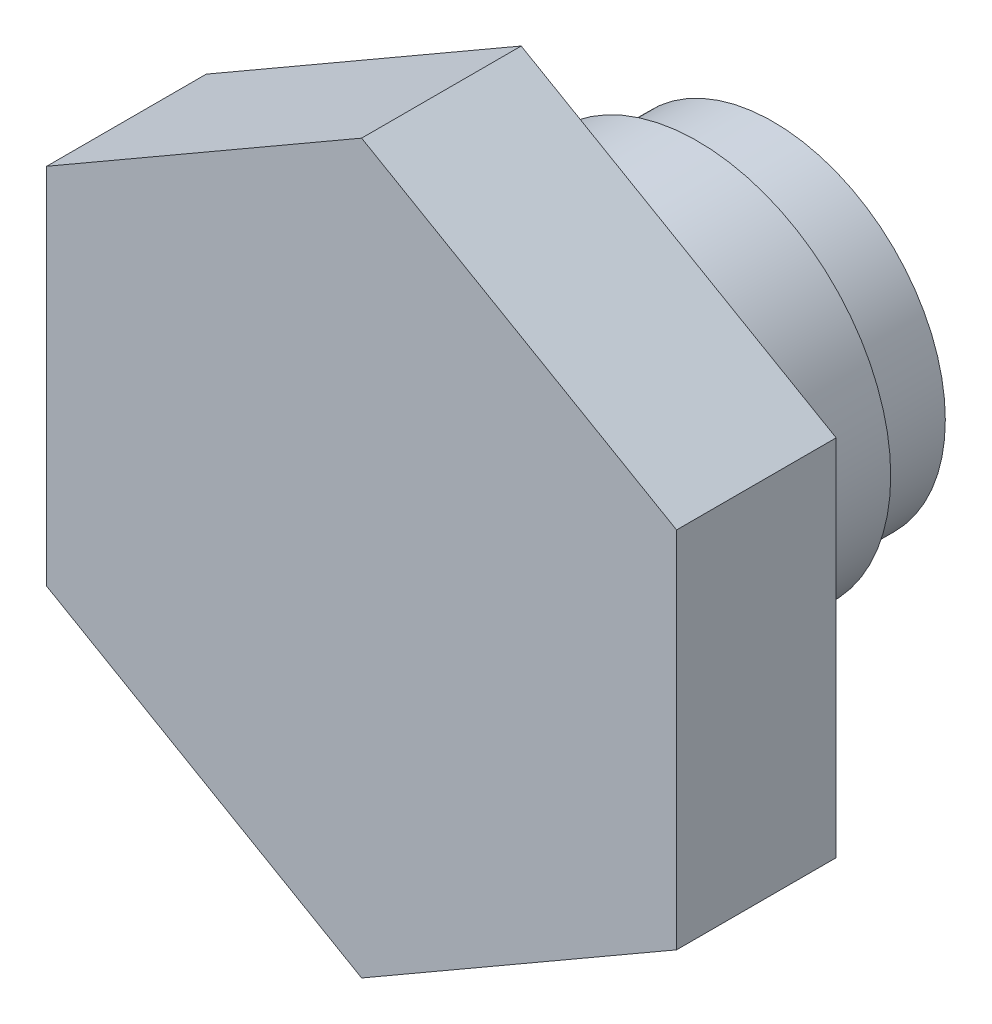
ISO-10303-21;
HEADER;
FILE_DESCRIPTION(('STEP AP214'),'2;1');
FILE_NAME('part.step','',(''),(''),'','','');
FILE_SCHEMA(('AUTOMOTIVE_DESIGN { 1 0 10303 214 1 1 1 1 }'));
ENDSEC;
DATA;
#1=APPLICATION_CONTEXT('core data for automotive mechanical design processes');
#2=APPLICATION_PROTOCOL_DEFINITION('international standard','automotive_design',2000,#1);
#3=PRODUCT_CONTEXT('',#1,'mechanical');
#4=PRODUCT('Part','Part','',(#3));
#5=PRODUCT_RELATED_PRODUCT_CATEGORY('part','',(#4));
#6=PRODUCT_DEFINITION_FORMATION('','',#4);
#7=PRODUCT_DEFINITION_CONTEXT('part definition',#1,'design');
#8=PRODUCT_DEFINITION('design','',#6,#7);
#9=PRODUCT_DEFINITION_SHAPE('','',#8);
#10=(LENGTH_UNIT() NAMED_UNIT(*) SI_UNIT(.MILLI.,.METRE.));
#11=(NAMED_UNIT(*) PLANE_ANGLE_UNIT() SI_UNIT($,.RADIAN.));
#12=(NAMED_UNIT(*) SI_UNIT($,.STERADIAN.) SOLID_ANGLE_UNIT());
#13=UNCERTAINTY_MEASURE_WITH_UNIT(LENGTH_MEASURE(1.E-05),#10,'distance_accuracy_value','');
#14=(GEOMETRIC_REPRESENTATION_CONTEXT(3) GLOBAL_UNCERTAINTY_ASSIGNED_CONTEXT((#13)) GLOBAL_UNIT_ASSIGNED_CONTEXT((#10,
#11,#12)) REPRESENTATION_CONTEXT('',''));
#15=CARTESIAN_POINT('',(0.,0.,0.));
#16=DIRECTION('',(0.,0.,1.));
#17=DIRECTION('',(1.,0.,0.));
#18=AXIS2_PLACEMENT_3D('',#15,#16,#17);
#19=CARTESIAN_POINT('',(0.,0.,0.));
#20=DIRECTION('',(0.,0.,1.));
#21=DIRECTION('',(1.,0.,0.));
#22=AXIS2_PLACEMENT_3D('',#19,#20,#21);
#23=PLANE('',#22);
#24=CARTESIAN_POINT('',(0.,0.,0.));
#25=DIRECTION('',(0.,0.,1.));
#26=DIRECTION('',(1.,0.,0.));
#27=AXIS2_PLACEMENT_3D('',#24,#25,#26);
#28=CIRCLE('',#27,5.207);
#29=CARTESIAN_POINT('',(5.20700000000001,0.,0.));
#30=VERTEX_POINT('',#29);
#31=EDGE_CURVE('E140',#30,#30,#28,.T.);
#32=ORIENTED_EDGE('',*,*,#31,.F.);
#33=EDGE_LOOP('',(#32));
#34=FACE_BOUND('',#33,.T.);
#35=CARTESIAN_POINT('',(0.,0.,0.));
#36=DIRECTION('',(0.,0.,1.));
#37=DIRECTION('',(1.,0.,0.));
#38=AXIS2_PLACEMENT_3D('',#35,#36,#37);
#39=CIRCLE('',#38,2.921);
#40=CARTESIAN_POINT('',(2.92100000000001,0.,0.));
#41=VERTEX_POINT('',#40);
#42=EDGE_CURVE('E11',#41,#41,#39,.F.);
#43=ORIENTED_EDGE('',*,*,#42,.F.);
#44=EDGE_LOOP('',(#43));
#45=FACE_BOUND('',#44,.T.);
#46=ADVANCED_FACE('F30',(#34,#45),#23,.F.);
#47=CARTESIAN_POINT('',(0.,0.,2.28600000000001));
#48=DIRECTION('',(0.,0.,-1.));
#49=DIRECTION('',(-1.,0.,0.));
#50=AXIS2_PLACEMENT_3D('',#47,#48,#49);
#51=CYLINDRICAL_SURFACE('',#50,5.207);
#52=CARTESIAN_POINT('',(0.,0.,2.28600000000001));
#53=DIRECTION('',(0.,0.,1.));
#54=DIRECTION('',(1.,0.,0.));
#55=AXIS2_PLACEMENT_3D('',#52,#53,#54);
#56=CIRCLE('',#55,5.207);
#57=CARTESIAN_POINT('',(5.20700000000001,0.,2.28600000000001));
#58=VERTEX_POINT('',#57);
#59=EDGE_CURVE('E40',#58,#58,#56,.T.);
#60=ORIENTED_EDGE('',*,*,#59,.F.);
#61=EDGE_LOOP('',(#60));
#62=FACE_BOUND('',#61,.T.);
#63=ORIENTED_EDGE('',*,*,#31,.T.);
#64=EDGE_LOOP('',(#63));
#65=FACE_BOUND('',#64,.T.);
#66=ADVANCED_FACE('F148',(#62,#65),#51,.T.);
#67=CARTESIAN_POINT('',(0.,0.,2.28600000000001));
#68=DIRECTION('',(0.,0.,1.));
#69=DIRECTION('',(1.,0.,0.));
#70=AXIS2_PLACEMENT_3D('',#67,#68,#69);
#71=PLANE('',#70);
#72=CARTESIAN_POINT('',(0.,0.,2.28600000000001));
#73=DIRECTION('',(0.,0.,1.));
#74=DIRECTION('',(1.,0.,0.));
#75=AXIS2_PLACEMENT_3D('',#72,#73,#74);
#76=CIRCLE('',#75,5.842);
#77=CARTESIAN_POINT('',(5.84200000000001,0.,2.28600000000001));
#78=VERTEX_POINT('',#77);
#79=EDGE_CURVE('E136',#78,#78,#76,.T.);
#80=ORIENTED_EDGE('',*,*,#79,.F.);
#81=EDGE_LOOP('',(#80));
#82=FACE_BOUND('',#81,.T.);
#83=ORIENTED_EDGE('',*,*,#59,.T.);
#84=EDGE_LOOP('',(#83));
#85=FACE_BOUND('',#84,.T.);
#86=ADVANCED_FACE('F190',(#82,#85),#71,.F.);
#87=CARTESIAN_POINT('',(0.,0.,7.61999999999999));
#88=DIRECTION('',(0.,0.,-1.));
#89=DIRECTION('',(-1.,0.,0.));
#90=AXIS2_PLACEMENT_3D('',#87,#88,#89);
#91=CYLINDRICAL_SURFACE('',#90,5.842);
#92=CARTESIAN_POINT('',(0.,0.,7.61999999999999));
#93=DIRECTION('',(0.,0.,1.));
#94=DIRECTION('',(1.,0.,0.));
#95=AXIS2_PLACEMENT_3D('',#92,#93,#94);
#96=CIRCLE('',#95,5.842);
#97=CARTESIAN_POINT('',(5.842,0.,7.61999999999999));
#98=VERTEX_POINT('',#97);
#99=EDGE_CURVE('E137',#98,#98,#96,.T.);
#100=ORIENTED_EDGE('',*,*,#99,.F.);
#101=EDGE_LOOP('',(#100));
#102=FACE_BOUND('',#101,.T.);
#103=ORIENTED_EDGE('',*,*,#79,.T.);
#104=EDGE_LOOP('',(#103));
#105=FACE_BOUND('',#104,.T.);
#106=ADVANCED_FACE('F172',(#102,#105),#91,.T.);
#107=CARTESIAN_POINT('',(0.,-10.9985226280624,7.61999999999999));
#108=DIRECTION('',(0.,0.,1.));
#109=DIRECTION('',(1.,0.,0.));
#110=AXIS2_PLACEMENT_3D('',#107,#108,#109);
#111=PLANE('',#110);
#112=DIRECTION('',(0.866025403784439,-0.5,0.));
#113=VECTOR('',#112,1.);
#114=CARTESIAN_POINT('',(-9.525,-5.4992613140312,7.62000000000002));
#115=LINE('',#114,#113);
#116=CARTESIAN_POINT('',(-9.525,-5.4992613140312,7.62000000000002));
#117=VERTEX_POINT('',#116);
#118=CARTESIAN_POINT('',(0.,-10.9985226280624,7.61999999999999));
#119=VERTEX_POINT('',#118);
#120=EDGE_CURVE('E117',#117,#119,#115,.T.);
#121=ORIENTED_EDGE('',*,*,#120,.F.);
#122=DIRECTION('',(0.,-1.,0.));
#123=VECTOR('',#122,1.);
#124=CARTESIAN_POINT('',(-9.52499999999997,5.49926131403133,7.62000000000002));
#125=LINE('',#124,#123);
#126=CARTESIAN_POINT('',(-9.52499999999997,5.49926131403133,7.62000000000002));
#127=VERTEX_POINT('',#126);
#128=EDGE_CURVE('E77',#127,#117,#125,.T.);
#129=ORIENTED_EDGE('',*,*,#128,.F.);
#130=DIRECTION('',(-0.866025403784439,-0.5,0.));
#131=VECTOR('',#130,1.);
#132=CARTESIAN_POINT('',(0.,10.9985226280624,7.61999999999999));
#133=LINE('',#132,#131);
#134=CARTESIAN_POINT('',(0.,10.9985226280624,7.61999999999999));
#135=VERTEX_POINT('',#134);
#136=EDGE_CURVE('E71',#135,#127,#133,.T.);
#137=ORIENTED_EDGE('',*,*,#136,.F.);
#138=DIRECTION('',(-0.866025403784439,0.5,0.));
#139=VECTOR('',#138,1.);
#140=CARTESIAN_POINT('',(9.52500000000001,5.49926131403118,7.61999999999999));
#141=LINE('',#140,#139);
#142=CARTESIAN_POINT('',(9.52500000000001,5.49926131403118,7.61999999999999));
#143=VERTEX_POINT('',#142);
#144=EDGE_CURVE('E107',#143,#135,#141,.T.);
#145=ORIENTED_EDGE('',*,*,#144,.F.);
#146=DIRECTION('',(0.,1.,0.));
#147=VECTOR('',#146,1.);
#148=CARTESIAN_POINT('',(9.525,-5.4992613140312,7.61999999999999));
#149=LINE('',#148,#147);
#150=CARTESIAN_POINT('',(9.525,-5.4992613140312,7.61999999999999));
#151=VERTEX_POINT('',#150);
#152=EDGE_CURVE('E122',#151,#143,#149,.T.);
#153=ORIENTED_EDGE('',*,*,#152,.F.);
#154=DIRECTION('',(0.866025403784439,0.5,0.));
#155=VECTOR('',#154,1.);
#156=CARTESIAN_POINT('',(0.,-10.9985226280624,7.61999999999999));
#157=LINE('',#156,#155);
#158=EDGE_CURVE('E120',#119,#151,#157,.T.);
#159=ORIENTED_EDGE('',*,*,#158,.F.);
#160=EDGE_LOOP('',(#121,#129,#137,#145,#153,#159));
#161=FACE_BOUND('',#160,.T.);
#162=ORIENTED_EDGE('',*,*,#99,.T.);
#163=EDGE_LOOP('',(#162));
#164=FACE_BOUND('',#163,.T.);
#165=ADVANCED_FACE('F168',(#161,#164),#111,.F.);
#166=CARTESIAN_POINT('',(-9.525,-5.4992613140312,12.446));
#167=DIRECTION('',(0.5,0.866025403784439,0.));
#168=DIRECTION('',(-0.866025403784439,0.5,0.));
#169=AXIS2_PLACEMENT_3D('',#166,#167,#168);
#170=PLANE('',#169);
#171=ORIENTED_EDGE('',*,*,#120,.T.);
#172=DIRECTION('',(0.,0.,-1.));
#173=VECTOR('',#172,1.);
#174=CARTESIAN_POINT('',(0.,-10.9985226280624,12.446));
#175=LINE('',#174,#173);
#176=CARTESIAN_POINT('',(0.,-10.9985226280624,12.446));
#177=VERTEX_POINT('',#176);
#178=EDGE_CURVE('E134',#177,#119,#175,.T.);
#179=ORIENTED_EDGE('',*,*,#178,.F.);
#180=DIRECTION('',(0.866025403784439,-0.5,0.));
#181=VECTOR('',#180,1.);
#182=CARTESIAN_POINT('',(-9.525,-5.4992613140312,12.446));
#183=LINE('',#182,#181);
#184=CARTESIAN_POINT('',(-9.525,-5.4992613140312,12.446));
#185=VERTEX_POINT('',#184);
#186=EDGE_CURVE('E127',#185,#177,#183,.T.);
#187=ORIENTED_EDGE('',*,*,#186,.F.);
#188=DIRECTION('',(0.,0.,-1.));
#189=VECTOR('',#188,1.);
#190=CARTESIAN_POINT('',(-9.525,-5.4992613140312,12.446));
#191=LINE('',#190,#189);
#192=EDGE_CURVE('E113',#185,#117,#191,.T.);
#193=ORIENTED_EDGE('',*,*,#192,.T.);
#194=EDGE_LOOP('',(#171,#179,#187,#193));
#195=FACE_BOUND('',#194,.T.);
#196=ADVANCED_FACE('F171',(#195),#170,.F.);
#197=CARTESIAN_POINT('',(0.,-10.9985226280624,12.446));
#198=DIRECTION('',(-0.5,0.866025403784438,0.));
#199=DIRECTION('',(-0.866025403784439,-0.5,0.));
#200=AXIS2_PLACEMENT_3D('',#197,#198,#199);
#201=PLANE('',#200);
#202=ORIENTED_EDGE('',*,*,#158,.T.);
#203=DIRECTION('',(0.,0.,-1.));
#204=VECTOR('',#203,1.);
#205=CARTESIAN_POINT('',(9.525,-5.4992613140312,12.446));
#206=LINE('',#205,#204);
#207=CARTESIAN_POINT('',(9.525,-5.4992613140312,12.446));
#208=VERTEX_POINT('',#207);
#209=EDGE_CURVE('E131',#208,#151,#206,.T.);
#210=ORIENTED_EDGE('',*,*,#209,.F.);
#211=DIRECTION('',(0.866025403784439,0.5,0.));
#212=VECTOR('',#211,1.);
#213=CARTESIAN_POINT('',(0.,-10.9985226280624,12.446));
#214=LINE('',#213,#212);
#215=EDGE_CURVE('E86',#177,#208,#214,.T.);
#216=ORIENTED_EDGE('',*,*,#215,.F.);
#217=ORIENTED_EDGE('',*,*,#178,.T.);
#218=EDGE_LOOP('',(#202,#210,#216,#217));
#219=FACE_BOUND('',#218,.T.);
#220=ADVANCED_FACE('F183',(#219),#201,.F.);
#221=CARTESIAN_POINT('',(9.525,-5.4992613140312,12.446));
#222=DIRECTION('',(-1.,0.,0.));
#223=DIRECTION('',(0.,0.,1.));
#224=AXIS2_PLACEMENT_3D('',#221,#222,#223);
#225=PLANE('',#224);
#226=ORIENTED_EDGE('',*,*,#152,.T.);
#227=DIRECTION('',(0.,0.,-1.));
#228=VECTOR('',#227,1.);
#229=CARTESIAN_POINT('',(9.52500000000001,5.49926131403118,12.446));
#230=LINE('',#229,#228);
#231=CARTESIAN_POINT('',(9.52500000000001,5.49926131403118,12.446));
#232=VERTEX_POINT('',#231);
#233=EDGE_CURVE('E108',#232,#143,#230,.T.);
#234=ORIENTED_EDGE('',*,*,#233,.F.);
#235=DIRECTION('',(0.,1.,0.));
#236=VECTOR('',#235,1.);
#237=CARTESIAN_POINT('',(9.525,-5.4992613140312,12.446));
#238=LINE('',#237,#236);
#239=EDGE_CURVE('E99',#208,#232,#238,.T.);
#240=ORIENTED_EDGE('',*,*,#239,.F.);
#241=ORIENTED_EDGE('',*,*,#209,.T.);
#242=EDGE_LOOP('',(#226,#234,#240,#241));
#243=FACE_BOUND('',#242,.T.);
#244=ADVANCED_FACE('F180',(#243),#225,.F.);
#245=CARTESIAN_POINT('',(9.52500000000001,5.49926131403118,12.446));
#246=DIRECTION('',(-0.5,-0.866025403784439,0.));
#247=DIRECTION('',(0.866025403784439,-0.5,0.));
#248=AXIS2_PLACEMENT_3D('',#245,#246,#247);
#249=PLANE('',#248);
#250=ORIENTED_EDGE('',*,*,#144,.T.);
#251=DIRECTION('',(0.,0.,-1.));
#252=VECTOR('',#251,1.);
#253=CARTESIAN_POINT('',(0.,10.9985226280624,12.446));
#254=LINE('',#253,#252);
#255=CARTESIAN_POINT('',(0.,10.9985226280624,12.446));
#256=VERTEX_POINT('',#255);
#257=EDGE_CURVE('E104',#256,#135,#254,.T.);
#258=ORIENTED_EDGE('',*,*,#257,.F.);
#259=DIRECTION('',(-0.866025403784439,0.5,0.));
#260=VECTOR('',#259,1.);
#261=CARTESIAN_POINT('',(9.52500000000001,5.49926131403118,12.446));
#262=LINE('',#261,#260);
#263=EDGE_CURVE('E93',#232,#256,#262,.T.);
#264=ORIENTED_EDGE('',*,*,#263,.F.);
#265=ORIENTED_EDGE('',*,*,#233,.T.);
#266=EDGE_LOOP('',(#250,#258,#264,#265));
#267=FACE_BOUND('',#266,.T.);
#268=ADVANCED_FACE('F105',(#267),#249,.F.);
#269=CARTESIAN_POINT('',(0.,10.9985226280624,12.446));
#270=DIRECTION('',(0.5,-0.866025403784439,0.));
#271=DIRECTION('',(0.866025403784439,0.5,0.));
#272=AXIS2_PLACEMENT_3D('',#269,#270,#271);
#273=PLANE('',#272);
#274=ORIENTED_EDGE('',*,*,#136,.T.);
#275=DIRECTION('',(0.,0.,-1.));
#276=VECTOR('',#275,1.);
#277=CARTESIAN_POINT('',(-9.52499999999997,5.49926131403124,12.446));
#278=LINE('',#277,#276);
#279=CARTESIAN_POINT('',(-9.52499999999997,5.49926131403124,12.446));
#280=VERTEX_POINT('',#279);
#281=EDGE_CURVE('E109',#280,#127,#278,.T.);
#282=ORIENTED_EDGE('',*,*,#281,.F.);
#283=DIRECTION('',(-0.866025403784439,-0.5,0.));
#284=VECTOR('',#283,1.);
#285=CARTESIAN_POINT('',(0.,10.9985226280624,12.446));
#286=LINE('',#285,#284);
#287=EDGE_CURVE('E97',#256,#280,#286,.T.);
#288=ORIENTED_EDGE('',*,*,#287,.F.);
#289=ORIENTED_EDGE('',*,*,#257,.T.);
#290=EDGE_LOOP('',(#274,#282,#288,#289));
#291=FACE_BOUND('',#290,.T.);
#292=ADVANCED_FACE('F111',(#291),#273,.F.);
#293=CARTESIAN_POINT('',(-9.52499999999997,5.49926131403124,12.446));
#294=DIRECTION('',(1.,0.,0.));
#295=DIRECTION('',(0.,1.,0.));
#296=AXIS2_PLACEMENT_3D('',#293,#294,#295);
#297=PLANE('',#296);
#298=ORIENTED_EDGE('',*,*,#128,.T.);
#299=ORIENTED_EDGE('',*,*,#192,.F.);
#300=DIRECTION('',(0.,-1.,0.));
#301=VECTOR('',#300,1.);
#302=CARTESIAN_POINT('',(-9.52499999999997,5.49926131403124,12.446));
#303=LINE('',#302,#301);
#304=EDGE_CURVE('E48',#280,#185,#303,.T.);
#305=ORIENTED_EDGE('',*,*,#304,.F.);
#306=ORIENTED_EDGE('',*,*,#281,.T.);
#307=EDGE_LOOP('',(#298,#299,#305,#306));
#308=FACE_BOUND('',#307,.T.);
#309=ADVANCED_FACE('F164',(#308),#297,.F.);
#310=CARTESIAN_POINT('',(0.,-10.9985226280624,12.446));
#311=DIRECTION('',(0.,0.,1.));
#312=DIRECTION('',(1.,0.,0.));
#313=AXIS2_PLACEMENT_3D('',#310,#311,#312);
#314=PLANE('',#313);
#315=ORIENTED_EDGE('',*,*,#186,.T.);
#316=ORIENTED_EDGE('',*,*,#215,.T.);
#317=ORIENTED_EDGE('',*,*,#239,.T.);
#318=ORIENTED_EDGE('',*,*,#263,.T.);
#319=ORIENTED_EDGE('',*,*,#287,.T.);
#320=ORIENTED_EDGE('',*,*,#304,.T.);
#321=EDGE_LOOP('',(#315,#316,#317,#318,#319,#320));
#322=FACE_BOUND('',#321,.T.);
#323=ADVANCED_FACE('F95',(#322),#314,.T.);
#324=CARTESIAN_POINT('',(0.,0.,-0.254000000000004));
#325=DIRECTION('',(0.,0.,1.));
#326=DIRECTION('',(1.,0.,0.));
#327=AXIS2_PLACEMENT_3D('',#324,#325,#326);
#328=CYLINDRICAL_SURFACE('',#327,2.921);
#329=CARTESIAN_POINT('',(0.,0.,-0.254000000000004));
#330=DIRECTION('',(0.,0.,-1.));
#331=DIRECTION('',(-1.,0.,0.));
#332=AXIS2_PLACEMENT_3D('',#329,#330,#331);
#333=CIRCLE('',#332,2.921);
#334=CARTESIAN_POINT('',(-2.921,0.,-0.254000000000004));
#335=VERTEX_POINT('',#334);
#336=EDGE_CURVE('E34',#335,#335,#333,.T.);
#337=ORIENTED_EDGE('',*,*,#336,.F.);
#338=EDGE_LOOP('',(#337));
#339=FACE_BOUND('',#338,.T.);
#340=ORIENTED_EDGE('',*,*,#42,.T.);
#341=EDGE_LOOP('',(#340));
#342=FACE_BOUND('',#341,.T.);
#343=ADVANCED_FACE('F155',(#339,#342),#328,.T.);
#344=CARTESIAN_POINT('',(0.,0.,0.155574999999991));
#345=DIRECTION('',(0.,0.,1.));
#346=DIRECTION('',(1.,0.,0.));
#347=AXIS2_PLACEMENT_3D('',#344,#345,#346);
#348=SPHERICAL_SURFACE('',#347,2.949575);
#349=ORIENTED_EDGE('',*,*,#336,.T.);
#350=EDGE_LOOP('',(#349));
#351=FACE_BOUND('',#350,.T.);
#352=ADVANCED_FACE('F32',(#351),#348,.T.);
#353=CLOSED_SHELL('',(#46,#66,#86,#106,#165,#196,#220,#244,#268,#292,#309,#323,#343,#352));
#354=MANIFOLD_SOLID_BREP('B2',#353);
#355=ADVANCED_BREP_SHAPE_REPRESENTATION('',(#18,#354),#14);
#356=SHAPE_DEFINITION_REPRESENTATION(#9,#355);
ENDSEC;
END-ISO-10303-21;
